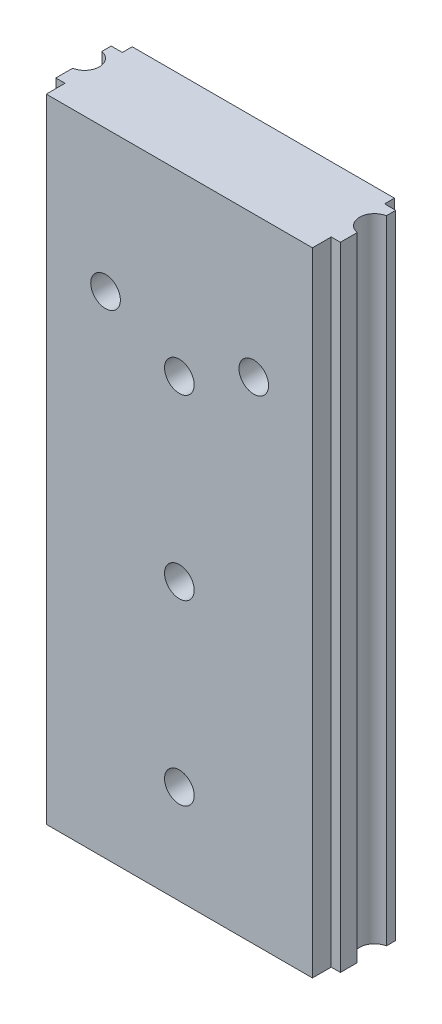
ISO-10303-21;
HEADER;
FILE_DESCRIPTION(('STEP AP214'),'2;1');
FILE_NAME('part.step','',(''),(''),'','','');
FILE_SCHEMA(('AUTOMOTIVE_DESIGN { 1 0 10303 214 1 1 1 1 }'));
ENDSEC;
DATA;
#1=APPLICATION_CONTEXT('core data for automotive mechanical design processes');
#2=APPLICATION_PROTOCOL_DEFINITION('international standard','automotive_design',2000,#1);
#3=PRODUCT_CONTEXT('',#1,'mechanical');
#4=PRODUCT('Part','Part','',(#3));
#5=PRODUCT_RELATED_PRODUCT_CATEGORY('part','',(#4));
#6=PRODUCT_DEFINITION_FORMATION('','',#4);
#7=PRODUCT_DEFINITION_CONTEXT('part definition',#1,'design');
#8=PRODUCT_DEFINITION('design','',#6,#7);
#9=PRODUCT_DEFINITION_SHAPE('','',#8);
#10=(LENGTH_UNIT() NAMED_UNIT(*) SI_UNIT(.MILLI.,.METRE.));
#11=(NAMED_UNIT(*) PLANE_ANGLE_UNIT() SI_UNIT($,.RADIAN.));
#12=(NAMED_UNIT(*) SI_UNIT($,.STERADIAN.) SOLID_ANGLE_UNIT());
#13=UNCERTAINTY_MEASURE_WITH_UNIT(LENGTH_MEASURE(1.E-05),#10,'distance_accuracy_value','');
#14=(GEOMETRIC_REPRESENTATION_CONTEXT(3) GLOBAL_UNCERTAINTY_ASSIGNED_CONTEXT((#13)) GLOBAL_UNIT_ASSIGNED_CONTEXT((#10,
#11,#12)) REPRESENTATION_CONTEXT('',''));
#15=CARTESIAN_POINT('',(0.,0.,0.));
#16=DIRECTION('',(0.,0.,1.));
#17=DIRECTION('',(1.,0.,0.));
#18=AXIS2_PLACEMENT_3D('',#15,#16,#17);
#19=CARTESIAN_POINT('',(28.8,64.,0.));
#20=DIRECTION('',(-1.,0.,0.));
#21=DIRECTION('',(0.,0.,1.));
#22=AXIS2_PLACEMENT_3D('',#19,#20,#21);
#23=PLANE('',#22);
#24=DIRECTION('',(0.,0.,-1.));
#25=VECTOR('',#24,1.);
#26=CARTESIAN_POINT('',(28.8,0.,0.));
#27=LINE('',#26,#25);
#28=CARTESIAN_POINT('',(28.8,0.,-1.9));
#29=VERTEX_POINT('',#28);
#30=CARTESIAN_POINT('',(28.8,0.,-3.6));
#31=VERTEX_POINT('',#30);
#32=EDGE_CURVE('E156',#29,#31,#27,.T.);
#33=ORIENTED_EDGE('',*,*,#32,.T.);
#34=DIRECTION('',(0.,1.,0.));
#35=VECTOR('',#34,1.);
#36=CARTESIAN_POINT('',(28.8,0.,-3.6));
#37=LINE('',#36,#35);
#38=CARTESIAN_POINT('',(28.8,64.,-3.6));
#39=VERTEX_POINT('',#38);
#40=EDGE_CURVE('E140',#31,#39,#37,.T.);
#41=ORIENTED_EDGE('',*,*,#40,.T.);
#42=DIRECTION('',(0.,0.,-1.));
#43=VECTOR('',#42,1.);
#44=CARTESIAN_POINT('',(28.8,64.,0.));
#45=LINE('',#44,#43);
#46=CARTESIAN_POINT('',(28.8,64.,-1.9));
#47=VERTEX_POINT('',#46);
#48=EDGE_CURVE('E34',#47,#39,#45,.T.);
#49=ORIENTED_EDGE('',*,*,#48,.F.);
#50=DIRECTION('',(0.,1.,0.));
#51=VECTOR('',#50,1.);
#52=CARTESIAN_POINT('',(28.8,0.,-1.9));
#53=LINE('',#52,#51);
#54=EDGE_CURVE('E157',#29,#47,#53,.T.);
#55=ORIENTED_EDGE('',*,*,#54,.F.);
#56=EDGE_LOOP('',(#33,#41,#49,#55));
#57=FACE_BOUND('',#56,.T.);
#58=ADVANCED_FACE('F26',(#57),#23,.F.);
#59=CARTESIAN_POINT('',(0.,64.,0.));
#60=DIRECTION('',(1.,0.,0.));
#61=DIRECTION('',(0.,0.,-1.));
#62=AXIS2_PLACEMENT_3D('',#59,#60,#61);
#63=PLANE('',#62);
#64=DIRECTION('',(0.,0.,1.));
#65=VECTOR('',#64,1.);
#66=CARTESIAN_POINT('',(0.,64.,0.));
#67=LINE('',#66,#65);
#68=CARTESIAN_POINT('',(0.,64.,-7.5));
#69=VERTEX_POINT('',#68);
#70=CARTESIAN_POINT('',(0.,64.,-6.55));
#71=VERTEX_POINT('',#70);
#72=EDGE_CURVE('E168',#69,#71,#67,.T.);
#73=ORIENTED_EDGE('',*,*,#72,.F.);
#74=DIRECTION('',(0.,1.,0.));
#75=VECTOR('',#74,1.);
#76=CARTESIAN_POINT('',(0.,0.,-7.5));
#77=LINE('',#76,#75);
#78=CARTESIAN_POINT('',(0.,0.,-7.5));
#79=VERTEX_POINT('',#78);
#80=EDGE_CURVE('E194',#79,#69,#77,.T.);
#81=ORIENTED_EDGE('',*,*,#80,.F.);
#82=DIRECTION('',(0.,0.,1.));
#83=VECTOR('',#82,1.);
#84=CARTESIAN_POINT('',(0.,0.,0.));
#85=LINE('',#84,#83);
#86=CARTESIAN_POINT('',(0.,0.,-6.55));
#87=VERTEX_POINT('',#86);
#88=EDGE_CURVE('E180',#79,#87,#85,.T.);
#89=ORIENTED_EDGE('',*,*,#88,.T.);
#90=DIRECTION('',(0.,1.,0.));
#91=VECTOR('',#90,1.);
#92=CARTESIAN_POINT('',(0.,0.,-6.55));
#93=LINE('',#92,#91);
#94=EDGE_CURVE('E191',#87,#71,#93,.T.);
#95=ORIENTED_EDGE('',*,*,#94,.T.);
#96=EDGE_LOOP('',(#73,#81,#89,#95));
#97=FACE_BOUND('',#96,.T.);
#98=ADVANCED_FACE('F326',(#97),#63,.F.);
#99=CARTESIAN_POINT('',(0.,0.,-3.6));
#100=VERTEX_POINT('',#99);
#101=CARTESIAN_POINT('',(0.,0.,-1.9));
#102=VERTEX_POINT('',#101);
#103=EDGE_CURVE('E181',#100,#102,#85,.T.);
#104=ORIENTED_EDGE('',*,*,#103,.T.);
#105=DIRECTION('',(0.,1.,0.));
#106=VECTOR('',#105,1.);
#107=CARTESIAN_POINT('',(0.,0.,-1.9));
#108=LINE('',#107,#106);
#109=CARTESIAN_POINT('',(0.,64.,-1.9));
#110=VERTEX_POINT('',#109);
#111=EDGE_CURVE('E185',#102,#110,#108,.T.);
#112=ORIENTED_EDGE('',*,*,#111,.T.);
#113=CARTESIAN_POINT('',(0.,64.,-3.6));
#114=VERTEX_POINT('',#113);
#115=EDGE_CURVE('E169',#114,#110,#67,.T.);
#116=ORIENTED_EDGE('',*,*,#115,.F.);
#117=DIRECTION('',(0.,1.,0.));
#118=VECTOR('',#117,1.);
#119=CARTESIAN_POINT('',(0.,0.,-3.6));
#120=LINE('',#119,#118);
#121=EDGE_CURVE('E188',#100,#114,#120,.T.);
#122=ORIENTED_EDGE('',*,*,#121,.F.);
#123=EDGE_LOOP('',(#104,#112,#116,#122));
#124=FACE_BOUND('',#123,.T.);
#125=ADVANCED_FACE('F28',(#124),#63,.F.);
#126=CARTESIAN_POINT('',(0.,64.,0.));
#127=DIRECTION('',(0.,0.,-1.));
#128=DIRECTION('',(-1.,0.,0.));
#129=AXIS2_PLACEMENT_3D('',#126,#127,#128);
#130=PLANE('',#129);
#131=CARTESIAN_POINT('',(6.93,49.7000153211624,0.));
#132=DIRECTION('',(0.,0.,-1.));
#133=DIRECTION('',(-1.,0.,0.));
#134=AXIS2_PLACEMENT_3D('',#131,#132,#133);
#135=CIRCLE('',#134,1.5);
#136=CARTESIAN_POINT('',(5.43,49.7000153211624,0.));
#137=VERTEX_POINT('',#136);
#138=EDGE_CURVE('E286',#137,#137,#135,.T.);
#139=ORIENTED_EDGE('',*,*,#138,.T.);
#140=EDGE_LOOP('',(#139));
#141=FACE_BOUND('',#140,.T.);
#142=CARTESIAN_POINT('',(21.93,49.7000153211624,0.));
#143=DIRECTION('',(0.,0.,-1.));
#144=DIRECTION('',(-1.,0.,0.));
#145=AXIS2_PLACEMENT_3D('',#142,#143,#144);
#146=CIRCLE('',#145,1.5);
#147=CARTESIAN_POINT('',(20.43,49.7000153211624,0.));
#148=VERTEX_POINT('',#147);
#149=EDGE_CURVE('E280',#148,#148,#146,.T.);
#150=ORIENTED_EDGE('',*,*,#149,.T.);
#151=EDGE_LOOP('',(#150));
#152=FACE_BOUND('',#151,.T.);
#153=CARTESIAN_POINT('',(14.3999999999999,46.,0.));
#154=DIRECTION('',(0.,0.,1.));
#155=DIRECTION('',(1.,0.,0.));
#156=AXIS2_PLACEMENT_3D('',#153,#154,#155);
#157=CIRCLE('',#156,1.5);
#158=CARTESIAN_POINT('',(15.8999999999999,46.,0.));
#159=VERTEX_POINT('',#158);
#160=EDGE_CURVE('E277',#159,#159,#157,.T.);
#161=ORIENTED_EDGE('',*,*,#160,.F.);
#162=EDGE_LOOP('',(#161));
#163=FACE_BOUND('',#162,.T.);
#164=CARTESIAN_POINT('',(14.3999999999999,28.,0.));
#165=DIRECTION('',(0.,0.,1.));
#166=DIRECTION('',(1.,0.,0.));
#167=AXIS2_PLACEMENT_3D('',#164,#165,#166);
#168=CIRCLE('',#167,1.5);
#169=CARTESIAN_POINT('',(15.8999999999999,28.,0.));
#170=VERTEX_POINT('',#169);
#171=EDGE_CURVE('E271',#170,#170,#168,.T.);
#172=ORIENTED_EDGE('',*,*,#171,.F.);
#173=EDGE_LOOP('',(#172));
#174=FACE_BOUND('',#173,.T.);
#175=CARTESIAN_POINT('',(14.4,10.,0.));
#176=DIRECTION('',(0.,0.,1.));
#177=DIRECTION('',(1.,0.,0.));
#178=AXIS2_PLACEMENT_3D('',#175,#176,#177);
#179=CIRCLE('',#178,1.5);
#180=CARTESIAN_POINT('',(15.9,10.,0.));
#181=VERTEX_POINT('',#180);
#182=EDGE_CURVE('E265',#181,#181,#179,.T.);
#183=ORIENTED_EDGE('',*,*,#182,.F.);
#184=EDGE_LOOP('',(#183));
#185=FACE_BOUND('',#184,.T.);
#186=DIRECTION('',(1.,0.,0.));
#187=VECTOR('',#186,1.);
#188=CARTESIAN_POINT('',(0.,0.,0.));
#189=LINE('',#188,#187);
#190=CARTESIAN_POINT('',(0.93,0.,0.));
#191=VERTEX_POINT('',#190);
#192=CARTESIAN_POINT('',(27.87,0.,0.));
#193=VERTEX_POINT('',#192);
#194=EDGE_CURVE('E177',#191,#193,#189,.T.);
#195=ORIENTED_EDGE('',*,*,#194,.T.);
#196=DIRECTION('',(0.,1.,0.));
#197=VECTOR('',#196,1.);
#198=CARTESIAN_POINT('',(27.87,0.,0.));
#199=LINE('',#198,#197);
#200=CARTESIAN_POINT('',(27.87,64.,0.));
#201=VERTEX_POINT('',#200);
#202=EDGE_CURVE('E234',#193,#201,#199,.T.);
#203=ORIENTED_EDGE('',*,*,#202,.T.);
#204=DIRECTION('',(1.,0.,0.));
#205=VECTOR('',#204,1.);
#206=CARTESIAN_POINT('',(0.,64.,0.));
#207=LINE('',#206,#205);
#208=CARTESIAN_POINT('',(0.93,64.,0.));
#209=VERTEX_POINT('',#208);
#210=EDGE_CURVE('E164',#209,#201,#207,.T.);
#211=ORIENTED_EDGE('',*,*,#210,.F.);
#212=DIRECTION('',(0.,1.,0.));
#213=VECTOR('',#212,1.);
#214=CARTESIAN_POINT('',(0.93,0.,0.));
#215=LINE('',#214,#213);
#216=EDGE_CURVE('E201',#191,#209,#215,.T.);
#217=ORIENTED_EDGE('',*,*,#216,.F.);
#218=EDGE_LOOP('',(#195,#203,#211,#217));
#219=FACE_BOUND('',#218,.T.);
#220=ADVANCED_FACE('F348',(#141,#152,#163,#174,#185,#219),#130,.F.);
#221=CARTESIAN_POINT('',(28.8,64.,-6.55));
#222=VERTEX_POINT('',#221);
#223=CARTESIAN_POINT('',(28.8,64.,-7.5));
#224=VERTEX_POINT('',#223);
#225=EDGE_CURVE('E163',#222,#224,#45,.T.);
#226=ORIENTED_EDGE('',*,*,#225,.F.);
#227=DIRECTION('',(0.,1.,0.));
#228=VECTOR('',#227,1.);
#229=CARTESIAN_POINT('',(28.8,0.,-6.55));
#230=LINE('',#229,#228);
#231=CARTESIAN_POINT('',(28.8,0.,-6.55));
#232=VERTEX_POINT('',#231);
#233=EDGE_CURVE('E143',#232,#222,#230,.T.);
#234=ORIENTED_EDGE('',*,*,#233,.F.);
#235=CARTESIAN_POINT('',(28.8,0.,-7.5));
#236=VERTEX_POINT('',#235);
#237=EDGE_CURVE('E174',#232,#236,#27,.T.);
#238=ORIENTED_EDGE('',*,*,#237,.T.);
#239=DIRECTION('',(0.,1.,0.));
#240=VECTOR('',#239,1.);
#241=CARTESIAN_POINT('',(28.8,0.,-7.5));
#242=LINE('',#241,#240);
#243=EDGE_CURVE('E241',#236,#224,#242,.T.);
#244=ORIENTED_EDGE('',*,*,#243,.T.);
#245=EDGE_LOOP('',(#226,#234,#238,#244));
#246=FACE_BOUND('',#245,.T.);
#247=ADVANCED_FACE('F298',(#246),#23,.F.);
#248=CARTESIAN_POINT('',(0.,64.,-8.5));
#249=DIRECTION('',(0.,0.,1.));
#250=DIRECTION('',(1.,0.,0.));
#251=AXIS2_PLACEMENT_3D('',#248,#249,#250);
#252=PLANE('',#251);
#253=CARTESIAN_POINT('',(6.93,49.7000153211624,-8.5));
#254=DIRECTION('',(0.,0.,-1.));
#255=DIRECTION('',(-1.,0.,0.));
#256=AXIS2_PLACEMENT_3D('',#253,#254,#255);
#257=CIRCLE('',#256,1.5);
#258=CARTESIAN_POINT('',(5.43,49.7000153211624,-8.5));
#259=VERTEX_POINT('',#258);
#260=EDGE_CURVE('E289',#259,#259,#257,.T.);
#261=ORIENTED_EDGE('',*,*,#260,.F.);
#262=EDGE_LOOP('',(#261));
#263=FACE_BOUND('',#262,.T.);
#264=CARTESIAN_POINT('',(21.93,49.7000153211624,-8.5));
#265=DIRECTION('',(0.,0.,-1.));
#266=DIRECTION('',(-1.,0.,0.));
#267=AXIS2_PLACEMENT_3D('',#264,#265,#266);
#268=CIRCLE('',#267,1.5);
#269=CARTESIAN_POINT('',(20.43,49.7000153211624,-8.5));
#270=VERTEX_POINT('',#269);
#271=EDGE_CURVE('E283',#270,#270,#268,.T.);
#272=ORIENTED_EDGE('',*,*,#271,.F.);
#273=EDGE_LOOP('',(#272));
#274=FACE_BOUND('',#273,.T.);
#275=CARTESIAN_POINT('',(14.3999999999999,46.,-8.5));
#276=DIRECTION('',(0.,0.,1.));
#277=DIRECTION('',(1.,0.,0.));
#278=AXIS2_PLACEMENT_3D('',#275,#276,#277);
#279=CIRCLE('',#278,1.5);
#280=CARTESIAN_POINT('',(15.8999999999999,46.,-8.5));
#281=VERTEX_POINT('',#280);
#282=EDGE_CURVE('E274',#281,#281,#279,.T.);
#283=ORIENTED_EDGE('',*,*,#282,.T.);
#284=EDGE_LOOP('',(#283));
#285=FACE_BOUND('',#284,.T.);
#286=CARTESIAN_POINT('',(14.3999999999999,28.,-8.5));
#287=DIRECTION('',(0.,0.,1.));
#288=DIRECTION('',(1.,0.,0.));
#289=AXIS2_PLACEMENT_3D('',#286,#287,#288);
#290=CIRCLE('',#289,1.5);
#291=CARTESIAN_POINT('',(15.8999999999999,28.,-8.5));
#292=VERTEX_POINT('',#291);
#293=EDGE_CURVE('E268',#292,#292,#290,.T.);
#294=ORIENTED_EDGE('',*,*,#293,.T.);
#295=EDGE_LOOP('',(#294));
#296=FACE_BOUND('',#295,.T.);
#297=CARTESIAN_POINT('',(14.4,10.,-8.5));
#298=DIRECTION('',(0.,0.,1.));
#299=DIRECTION('',(1.,0.,0.));
#300=AXIS2_PLACEMENT_3D('',#297,#298,#299);
#301=CIRCLE('',#300,1.5);
#302=CARTESIAN_POINT('',(15.9,10.,-8.5));
#303=VERTEX_POINT('',#302);
#304=EDGE_CURVE('E149',#303,#303,#301,.T.);
#305=ORIENTED_EDGE('',*,*,#304,.T.);
#306=EDGE_LOOP('',(#305));
#307=FACE_BOUND('',#306,.T.);
#308=DIRECTION('',(-1.,0.,0.));
#309=VECTOR('',#308,1.);
#310=CARTESIAN_POINT('',(0.,64.,-8.5));
#311=LINE('',#310,#309);
#312=CARTESIAN_POINT('',(27.67,64.,-8.5));
#313=VERTEX_POINT('',#312);
#314=CARTESIAN_POINT('',(1.13,64.,-8.5));
#315=VERTEX_POINT('',#314);
#316=EDGE_CURVE('E11',#313,#315,#311,.T.);
#317=ORIENTED_EDGE('',*,*,#316,.F.);
#318=DIRECTION('',(0.,1.,0.));
#319=VECTOR('',#318,1.);
#320=CARTESIAN_POINT('',(27.67,0.,-8.5));
#321=LINE('',#320,#319);
#322=CARTESIAN_POINT('',(27.67,0.,-8.5));
#323=VERTEX_POINT('',#322);
#324=EDGE_CURVE('E237',#323,#313,#321,.T.);
#325=ORIENTED_EDGE('',*,*,#324,.F.);
#326=DIRECTION('',(-1.,0.,0.));
#327=VECTOR('',#326,1.);
#328=CARTESIAN_POINT('',(0.,0.,-8.5));
#329=LINE('',#328,#327);
#330=CARTESIAN_POINT('',(1.13,0.,-8.5));
#331=VERTEX_POINT('',#330);
#332=EDGE_CURVE('E172',#323,#331,#329,.T.);
#333=ORIENTED_EDGE('',*,*,#332,.T.);
#334=DIRECTION('',(0.,1.,0.));
#335=VECTOR('',#334,1.);
#336=CARTESIAN_POINT('',(1.13,0.,-8.5));
#337=LINE('',#336,#335);
#338=EDGE_CURVE('E198',#331,#315,#337,.T.);
#339=ORIENTED_EDGE('',*,*,#338,.T.);
#340=EDGE_LOOP('',(#317,#325,#333,#339));
#341=FACE_BOUND('',#340,.T.);
#342=ADVANCED_FACE('F295',(#263,#274,#285,#296,#307,#341),#252,.F.);
#343=CARTESIAN_POINT('',(0.,64.,-8.5));
#344=DIRECTION('',(0.,-1.,0.));
#345=DIRECTION('',(0.,0.,-1.));
#346=AXIS2_PLACEMENT_3D('',#343,#344,#345);
#347=PLANE('',#346);
#348=ORIENTED_EDGE('',*,*,#48,.T.);
#349=CARTESIAN_POINT('',(29.0727178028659,64.,-5.075));
#350=DIRECTION('',(0.,1.,0.));
#351=DIRECTION('',(0.,0.,-1.));
#352=AXIS2_PLACEMENT_3D('',#349,#350,#351);
#353=CIRCLE('',#352,1.5);
#354=EDGE_CURVE('E137',#222,#39,#353,.T.);
#355=ORIENTED_EDGE('',*,*,#354,.F.);
#356=ORIENTED_EDGE('',*,*,#225,.T.);
#357=DIRECTION('',(1.,0.,0.));
#358=VECTOR('',#357,1.);
#359=CARTESIAN_POINT('',(27.67,64.,-7.5));
#360=LINE('',#359,#358);
#361=CARTESIAN_POINT('',(27.67,64.,-7.5));
#362=VERTEX_POINT('',#361);
#363=EDGE_CURVE('E255',#362,#224,#360,.T.);
#364=ORIENTED_EDGE('',*,*,#363,.F.);
#365=DIRECTION('',(0.,0.,1.));
#366=VECTOR('',#365,1.);
#367=CARTESIAN_POINT('',(27.67,64.,-8.5));
#368=LINE('',#367,#366);
#369=EDGE_CURVE('E257',#313,#362,#368,.T.);
#370=ORIENTED_EDGE('',*,*,#369,.F.);
#371=ORIENTED_EDGE('',*,*,#316,.T.);
#372=DIRECTION('',(0.,0.,-1.));
#373=VECTOR('',#372,1.);
#374=CARTESIAN_POINT('',(1.13,64.,-8.5));
#375=LINE('',#374,#373);
#376=CARTESIAN_POINT('',(1.13,64.,-7.5));
#377=VERTEX_POINT('',#376);
#378=EDGE_CURVE('E221',#377,#315,#375,.T.);
#379=ORIENTED_EDGE('',*,*,#378,.F.);
#380=DIRECTION('',(1.,0.,0.));
#381=VECTOR('',#380,1.);
#382=CARTESIAN_POINT('',(1.13,64.,-7.5));
#383=LINE('',#382,#381);
#384=EDGE_CURVE('E224',#69,#377,#383,.T.);
#385=ORIENTED_EDGE('',*,*,#384,.F.);
#386=ORIENTED_EDGE('',*,*,#72,.T.);
#387=CARTESIAN_POINT('',(-0.272717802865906,64.,-5.075));
#388=DIRECTION('',(0.,1.,0.));
#389=DIRECTION('',(0.,0.,1.));
#390=AXIS2_PLACEMENT_3D('',#387,#388,#389);
#391=CIRCLE('',#390,1.5);
#392=EDGE_CURVE('E227',#114,#71,#391,.T.);
#393=ORIENTED_EDGE('',*,*,#392,.F.);
#394=ORIENTED_EDGE('',*,*,#115,.T.);
#395=DIRECTION('',(-1.,0.,0.));
#396=VECTOR('',#395,1.);
#397=CARTESIAN_POINT('',(0.,64.,-1.9));
#398=LINE('',#397,#396);
#399=CARTESIAN_POINT('',(0.93,64.,-1.9));
#400=VERTEX_POINT('',#399);
#401=EDGE_CURVE('E229',#400,#110,#398,.T.);
#402=ORIENTED_EDGE('',*,*,#401,.F.);
#403=DIRECTION('',(0.,0.,-1.));
#404=VECTOR('',#403,1.);
#405=CARTESIAN_POINT('',(0.93,64.,-1.9));
#406=LINE('',#405,#404);
#407=EDGE_CURVE('E218',#209,#400,#406,.T.);
#408=ORIENTED_EDGE('',*,*,#407,.F.);
#409=ORIENTED_EDGE('',*,*,#210,.T.);
#410=DIRECTION('',(0.,0.,1.));
#411=VECTOR('',#410,1.);
#412=CARTESIAN_POINT('',(27.87,64.,-1.9));
#413=LINE('',#412,#411);
#414=CARTESIAN_POINT('',(27.87,64.,-1.9));
#415=VERTEX_POINT('',#414);
#416=EDGE_CURVE('E260',#415,#201,#413,.T.);
#417=ORIENTED_EDGE('',*,*,#416,.F.);
#418=DIRECTION('',(-1.,0.,0.));
#419=VECTOR('',#418,1.);
#420=CARTESIAN_POINT('',(28.8,64.,-1.9));
#421=LINE('',#420,#419);
#422=EDGE_CURVE('E148',#47,#415,#421,.T.);
#423=ORIENTED_EDGE('',*,*,#422,.F.);
#424=EDGE_LOOP('',(#348,#355,#356,#364,#370,#371,#379,#385,#386,#393,#394,#402,#408,#409,#417,#423));
#425=FACE_BOUND('',#424,.T.);
#426=ADVANCED_FACE('F160',(#425),#347,.F.);
#427=CARTESIAN_POINT('',(0.,0.,-8.5));
#428=DIRECTION('',(0.,-1.,0.));
#429=DIRECTION('',(0.,0.,-1.));
#430=AXIS2_PLACEMENT_3D('',#427,#428,#429);
#431=PLANE('',#430);
#432=CARTESIAN_POINT('',(29.0727178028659,0.,-5.075));
#433=DIRECTION('',(0.,1.,0.));
#434=DIRECTION('',(0.,0.,-1.));
#435=AXIS2_PLACEMENT_3D('',#432,#433,#434);
#436=CIRCLE('',#435,1.5);
#437=EDGE_CURVE('E253',#232,#31,#436,.T.);
#438=ORIENTED_EDGE('',*,*,#437,.T.);
#439=ORIENTED_EDGE('',*,*,#32,.F.);
#440=DIRECTION('',(-1.,0.,0.));
#441=VECTOR('',#440,1.);
#442=CARTESIAN_POINT('',(28.8,0.,-1.9));
#443=LINE('',#442,#441);
#444=CARTESIAN_POINT('',(27.87,0.,-1.9));
#445=VERTEX_POINT('',#444);
#446=EDGE_CURVE('E250',#29,#445,#443,.T.);
#447=ORIENTED_EDGE('',*,*,#446,.T.);
#448=DIRECTION('',(0.,0.,1.));
#449=VECTOR('',#448,1.);
#450=CARTESIAN_POINT('',(27.87,0.,-1.9));
#451=LINE('',#450,#449);
#452=EDGE_CURVE('E49',#445,#193,#451,.T.);
#453=ORIENTED_EDGE('',*,*,#452,.T.);
#454=ORIENTED_EDGE('',*,*,#194,.F.);
#455=DIRECTION('',(0.,0.,-1.));
#456=VECTOR('',#455,1.);
#457=CARTESIAN_POINT('',(0.93,0.,-1.9));
#458=LINE('',#457,#456);
#459=CARTESIAN_POINT('',(0.93,0.,-1.9));
#460=VERTEX_POINT('',#459);
#461=EDGE_CURVE('E189',#191,#460,#458,.T.);
#462=ORIENTED_EDGE('',*,*,#461,.T.);
#463=DIRECTION('',(-1.,0.,0.));
#464=VECTOR('',#463,1.);
#465=CARTESIAN_POINT('',(0.,0.,-1.9));
#466=LINE('',#465,#464);
#467=EDGE_CURVE('E215',#460,#102,#466,.T.);
#468=ORIENTED_EDGE('',*,*,#467,.T.);
#469=ORIENTED_EDGE('',*,*,#103,.F.);
#470=CARTESIAN_POINT('',(-0.272717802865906,0.,-5.075));
#471=DIRECTION('',(0.,1.,0.));
#472=DIRECTION('',(0.,0.,1.));
#473=AXIS2_PLACEMENT_3D('',#470,#471,#472);
#474=CIRCLE('',#473,1.5);
#475=EDGE_CURVE('E212',#100,#87,#474,.T.);
#476=ORIENTED_EDGE('',*,*,#475,.T.);
#477=ORIENTED_EDGE('',*,*,#88,.F.);
#478=DIRECTION('',(1.,0.,0.));
#479=VECTOR('',#478,1.);
#480=CARTESIAN_POINT('',(1.13,0.,-7.5));
#481=LINE('',#480,#479);
#482=CARTESIAN_POINT('',(1.13,0.,-7.5));
#483=VERTEX_POINT('',#482);
#484=EDGE_CURVE('E209',#79,#483,#481,.T.);
#485=ORIENTED_EDGE('',*,*,#484,.T.);
#486=DIRECTION('',(0.,0.,-1.));
#487=VECTOR('',#486,1.);
#488=CARTESIAN_POINT('',(1.13,0.,-8.5));
#489=LINE('',#488,#487);
#490=EDGE_CURVE('E206',#483,#331,#489,.T.);
#491=ORIENTED_EDGE('',*,*,#490,.T.);
#492=ORIENTED_EDGE('',*,*,#332,.F.);
#493=DIRECTION('',(0.,0.,1.));
#494=VECTOR('',#493,1.);
#495=CARTESIAN_POINT('',(27.67,0.,-8.5));
#496=LINE('',#495,#494);
#497=CARTESIAN_POINT('',(27.67,0.,-7.5));
#498=VERTEX_POINT('',#497);
#499=EDGE_CURVE('E246',#323,#498,#496,.T.);
#500=ORIENTED_EDGE('',*,*,#499,.T.);
#501=DIRECTION('',(1.,0.,0.));
#502=VECTOR('',#501,1.);
#503=CARTESIAN_POINT('',(27.67,0.,-7.5));
#504=LINE('',#503,#502);
#505=EDGE_CURVE('E41',#498,#236,#504,.T.);
#506=ORIENTED_EDGE('',*,*,#505,.T.);
#507=ORIENTED_EDGE('',*,*,#237,.F.);
#508=EDGE_LOOP('',(#438,#439,#447,#453,#454,#462,#468,#469,#476,#477,#485,#491,#492,#500,#506,#507));
#509=FACE_BOUND('',#508,.T.);
#510=ADVANCED_FACE('F334',(#509),#431,.T.);
#511=CARTESIAN_POINT('',(-0.272717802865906,0.,-5.075));
#512=DIRECTION('',(0.,1.,0.));
#513=DIRECTION('',(0.,0.,1.));
#514=AXIS2_PLACEMENT_3D('',#511,#512,#513);
#515=CYLINDRICAL_SURFACE('',#514,1.5);
#516=ORIENTED_EDGE('',*,*,#392,.T.);
#517=ORIENTED_EDGE('',*,*,#94,.F.);
#518=ORIENTED_EDGE('',*,*,#475,.F.);
#519=ORIENTED_EDGE('',*,*,#121,.T.);
#520=EDGE_LOOP('',(#516,#517,#518,#519));
#521=FACE_BOUND('',#520,.T.);
#522=ADVANCED_FACE('F330',(#521),#515,.F.);
#523=CARTESIAN_POINT('',(1.13,0.,-7.5));
#524=DIRECTION('',(0.,0.,1.));
#525=DIRECTION('',(1.,0.,0.));
#526=AXIS2_PLACEMENT_3D('',#523,#524,#525);
#527=PLANE('',#526);
#528=ORIENTED_EDGE('',*,*,#384,.T.);
#529=DIRECTION('',(0.,1.,0.));
#530=VECTOR('',#529,1.);
#531=CARTESIAN_POINT('',(1.13,0.,-7.5));
#532=LINE('',#531,#530);
#533=EDGE_CURVE('E196',#483,#377,#532,.T.);
#534=ORIENTED_EDGE('',*,*,#533,.F.);
#535=ORIENTED_EDGE('',*,*,#484,.F.);
#536=ORIENTED_EDGE('',*,*,#80,.T.);
#537=EDGE_LOOP('',(#528,#534,#535,#536));
#538=FACE_BOUND('',#537,.T.);
#539=ADVANCED_FACE('F320',(#538),#527,.F.);
#540=CARTESIAN_POINT('',(1.13,0.,-8.5));
#541=DIRECTION('',(1.,0.,0.));
#542=DIRECTION('',(0.,0.,-1.));
#543=AXIS2_PLACEMENT_3D('',#540,#541,#542);
#544=PLANE('',#543);
#545=ORIENTED_EDGE('',*,*,#378,.T.);
#546=ORIENTED_EDGE('',*,*,#338,.F.);
#547=ORIENTED_EDGE('',*,*,#490,.F.);
#548=ORIENTED_EDGE('',*,*,#533,.T.);
#549=EDGE_LOOP('',(#545,#546,#547,#548));
#550=FACE_BOUND('',#549,.T.);
#551=ADVANCED_FACE('F317',(#550),#544,.F.);
#552=CARTESIAN_POINT('',(0.,0.,-1.9));
#553=DIRECTION('',(0.,0.,-1.));
#554=DIRECTION('',(-1.,0.,0.));
#555=AXIS2_PLACEMENT_3D('',#552,#553,#554);
#556=PLANE('',#555);
#557=ORIENTED_EDGE('',*,*,#401,.T.);
#558=ORIENTED_EDGE('',*,*,#111,.F.);
#559=ORIENTED_EDGE('',*,*,#467,.F.);
#560=DIRECTION('',(0.,1.,0.));
#561=VECTOR('',#560,1.);
#562=CARTESIAN_POINT('',(0.93,0.,-1.9));
#563=LINE('',#562,#561);
#564=EDGE_CURVE('E184',#460,#400,#563,.T.);
#565=ORIENTED_EDGE('',*,*,#564,.T.);
#566=EDGE_LOOP('',(#557,#558,#559,#565));
#567=FACE_BOUND('',#566,.T.);
#568=ADVANCED_FACE('F341',(#567),#556,.F.);
#569=CARTESIAN_POINT('',(0.93,0.,-1.9));
#570=DIRECTION('',(1.,0.,0.));
#571=DIRECTION('',(0.,0.,-1.));
#572=AXIS2_PLACEMENT_3D('',#569,#570,#571);
#573=PLANE('',#572);
#574=ORIENTED_EDGE('',*,*,#407,.T.);
#575=ORIENTED_EDGE('',*,*,#564,.F.);
#576=ORIENTED_EDGE('',*,*,#461,.F.);
#577=ORIENTED_EDGE('',*,*,#216,.T.);
#578=EDGE_LOOP('',(#574,#575,#576,#577));
#579=FACE_BOUND('',#578,.T.);
#580=ADVANCED_FACE('F344',(#579),#573,.F.);
#581=CARTESIAN_POINT('',(28.8,0.,-1.9));
#582=DIRECTION('',(0.,0.,-1.));
#583=DIRECTION('',(-1.,0.,0.));
#584=AXIS2_PLACEMENT_3D('',#581,#582,#583);
#585=PLANE('',#584);
#586=ORIENTED_EDGE('',*,*,#422,.T.);
#587=DIRECTION('',(0.,1.,0.));
#588=VECTOR('',#587,1.);
#589=CARTESIAN_POINT('',(27.87,0.,-1.9));
#590=LINE('',#589,#588);
#591=EDGE_CURVE('E232',#445,#415,#590,.T.);
#592=ORIENTED_EDGE('',*,*,#591,.F.);
#593=ORIENTED_EDGE('',*,*,#446,.F.);
#594=ORIENTED_EDGE('',*,*,#54,.T.);
#595=EDGE_LOOP('',(#586,#592,#593,#594));
#596=FACE_BOUND('',#595,.T.);
#597=ADVANCED_FACE('F350',(#596),#585,.F.);
#598=CARTESIAN_POINT('',(27.87,0.,-1.9));
#599=DIRECTION('',(-1.,0.,0.));
#600=DIRECTION('',(0.,0.,1.));
#601=AXIS2_PLACEMENT_3D('',#598,#599,#600);
#602=PLANE('',#601);
#603=ORIENTED_EDGE('',*,*,#416,.T.);
#604=ORIENTED_EDGE('',*,*,#202,.F.);
#605=ORIENTED_EDGE('',*,*,#452,.F.);
#606=ORIENTED_EDGE('',*,*,#591,.T.);
#607=EDGE_LOOP('',(#603,#604,#605,#606));
#608=FACE_BOUND('',#607,.T.);
#609=ADVANCED_FACE('F351',(#608),#602,.F.);
#610=CARTESIAN_POINT('',(27.67,0.,-8.5));
#611=DIRECTION('',(-1.,0.,0.));
#612=DIRECTION('',(0.,0.,1.));
#613=AXIS2_PLACEMENT_3D('',#610,#611,#612);
#614=PLANE('',#613);
#615=ORIENTED_EDGE('',*,*,#369,.T.);
#616=DIRECTION('',(0.,1.,0.));
#617=VECTOR('',#616,1.);
#618=CARTESIAN_POINT('',(27.67,0.,-7.5));
#619=LINE('',#618,#617);
#620=EDGE_CURVE('E239',#498,#362,#619,.T.);
#621=ORIENTED_EDGE('',*,*,#620,.F.);
#622=ORIENTED_EDGE('',*,*,#499,.F.);
#623=ORIENTED_EDGE('',*,*,#324,.T.);
#624=EDGE_LOOP('',(#615,#621,#622,#623));
#625=FACE_BOUND('',#624,.T.);
#626=ADVANCED_FACE('F353',(#625),#614,.F.);
#627=CARTESIAN_POINT('',(27.67,0.,-7.5));
#628=DIRECTION('',(0.,0.,1.));
#629=DIRECTION('',(1.,0.,0.));
#630=AXIS2_PLACEMENT_3D('',#627,#628,#629);
#631=PLANE('',#630);
#632=ORIENTED_EDGE('',*,*,#363,.T.);
#633=ORIENTED_EDGE('',*,*,#243,.F.);
#634=ORIENTED_EDGE('',*,*,#505,.F.);
#635=ORIENTED_EDGE('',*,*,#620,.T.);
#636=EDGE_LOOP('',(#632,#633,#634,#635));
#637=FACE_BOUND('',#636,.T.);
#638=ADVANCED_FACE('F359',(#637),#631,.F.);
#639=CARTESIAN_POINT('',(29.0727178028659,0.,-5.075));
#640=DIRECTION('',(0.,1.,0.));
#641=DIRECTION('',(0.,0.,1.));
#642=AXIS2_PLACEMENT_3D('',#639,#640,#641);
#643=CYLINDRICAL_SURFACE('',#642,1.5);
#644=ORIENTED_EDGE('',*,*,#354,.T.);
#645=ORIENTED_EDGE('',*,*,#40,.F.);
#646=ORIENTED_EDGE('',*,*,#437,.F.);
#647=ORIENTED_EDGE('',*,*,#233,.T.);
#648=EDGE_LOOP('',(#644,#645,#646,#647));
#649=FACE_BOUND('',#648,.T.);
#650=ADVANCED_FACE('F139',(#649),#643,.F.);
#651=CARTESIAN_POINT('',(14.4,10.,-8.5));
#652=DIRECTION('',(0.,0.,1.));
#653=DIRECTION('',(1.,0.,0.));
#654=AXIS2_PLACEMENT_3D('',#651,#652,#653);
#655=CYLINDRICAL_SURFACE('',#654,1.5);
#656=ORIENTED_EDGE('',*,*,#304,.F.);
#657=EDGE_LOOP('',(#656));
#658=FACE_BOUND('',#657,.T.);
#659=ORIENTED_EDGE('',*,*,#182,.T.);
#660=EDGE_LOOP('',(#659));
#661=FACE_BOUND('',#660,.T.);
#662=ADVANCED_FACE('F382',(#658,#661),#655,.F.);
#663=CARTESIAN_POINT('',(14.3999999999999,28.,-8.5));
#664=DIRECTION('',(0.,0.,1.));
#665=DIRECTION('',(1.,0.,0.));
#666=AXIS2_PLACEMENT_3D('',#663,#664,#665);
#667=CYLINDRICAL_SURFACE('',#666,1.5);
#668=ORIENTED_EDGE('',*,*,#293,.F.);
#669=EDGE_LOOP('',(#668));
#670=FACE_BOUND('',#669,.T.);
#671=ORIENTED_EDGE('',*,*,#171,.T.);
#672=EDGE_LOOP('',(#671));
#673=FACE_BOUND('',#672,.T.);
#674=ADVANCED_FACE('F387',(#670,#673),#667,.F.);
#675=CARTESIAN_POINT('',(14.3999999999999,46.,-8.5));
#676=DIRECTION('',(0.,0.,1.));
#677=DIRECTION('',(1.,0.,0.));
#678=AXIS2_PLACEMENT_3D('',#675,#676,#677);
#679=CYLINDRICAL_SURFACE('',#678,1.5);
#680=ORIENTED_EDGE('',*,*,#282,.F.);
#681=EDGE_LOOP('',(#680));
#682=FACE_BOUND('',#681,.T.);
#683=ORIENTED_EDGE('',*,*,#160,.T.);
#684=EDGE_LOOP('',(#683));
#685=FACE_BOUND('',#684,.T.);
#686=ADVANCED_FACE('F391',(#682,#685),#679,.F.);
#687=CARTESIAN_POINT('',(21.93,49.7000153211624,0.));
#688=DIRECTION('',(0.,0.,-1.));
#689=DIRECTION('',(-1.,0.,0.));
#690=AXIS2_PLACEMENT_3D('',#687,#688,#689);
#691=CYLINDRICAL_SURFACE('',#690,1.5);
#692=ORIENTED_EDGE('',*,*,#149,.F.);
#693=EDGE_LOOP('',(#692));
#694=FACE_BOUND('',#693,.T.);
#695=ORIENTED_EDGE('',*,*,#271,.T.);
#696=EDGE_LOOP('',(#695));
#697=FACE_BOUND('',#696,.T.);
#698=ADVANCED_FACE('F395',(#694,#697),#691,.F.);
#699=CARTESIAN_POINT('',(6.93,49.7000153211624,0.));
#700=DIRECTION('',(0.,0.,-1.));
#701=DIRECTION('',(-1.,0.,0.));
#702=AXIS2_PLACEMENT_3D('',#699,#700,#701);
#703=CYLINDRICAL_SURFACE('',#702,1.5);
#704=ORIENTED_EDGE('',*,*,#138,.F.);
#705=EDGE_LOOP('',(#704));
#706=FACE_BOUND('',#705,.T.);
#707=ORIENTED_EDGE('',*,*,#260,.T.);
#708=EDGE_LOOP('',(#707));
#709=FACE_BOUND('',#708,.T.);
#710=ADVANCED_FACE('F293',(#706,#709),#703,.F.);
#711=CLOSED_SHELL('',(#58,#98,#125,#220,#247,#342,#426,#510,#522,#539,#551,#568,#580,#597,#609,
#626,#638,#650,#662,#674,#686,#698,#710));
#712=MANIFOLD_SOLID_BREP('B2',#711);
#713=ADVANCED_BREP_SHAPE_REPRESENTATION('',(#18,#712),#14);
#714=SHAPE_DEFINITION_REPRESENTATION(#9,#713);
ENDSEC;
END-ISO-10303-21;
